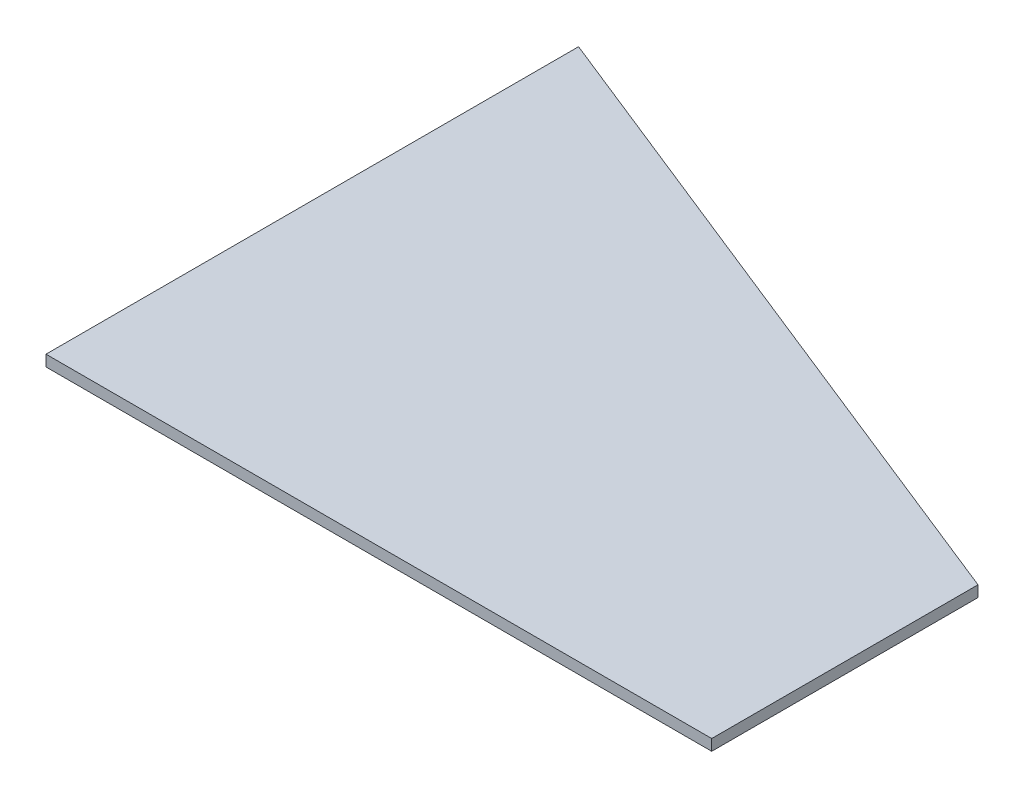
from build123d import *


with BuildPart() as part:
    # Sketch1 → Tapered_plywood_panel section 0
    with BuildSketch(Plane.YZ):
        with BuildLine():
            Line((152.4, -152.4), (158.75, -152.4))
            Line((158.75, -152.4), (158.75, 152.4))
            Line((158.75, 152.4), (152.4, 152.4))
            Line((152.4, 152.4), (152.4, -152.4))
        make_face()
    # Sketch2 → Tapered_plywood_panel section 1
    with BuildSketch(Plane.YZ.offset(304.8)):
        with BuildLine():
            Line((76.2, -76.2), (82.55, -76.2))
            Line((82.55, -76.2), (82.55, 76.2))
            Line((82.55, 76.2), (76.2, 76.2))
            Line((76.2, 76.2), (76.2, -76.2))
        make_face()
    loft()


solid = part.part
